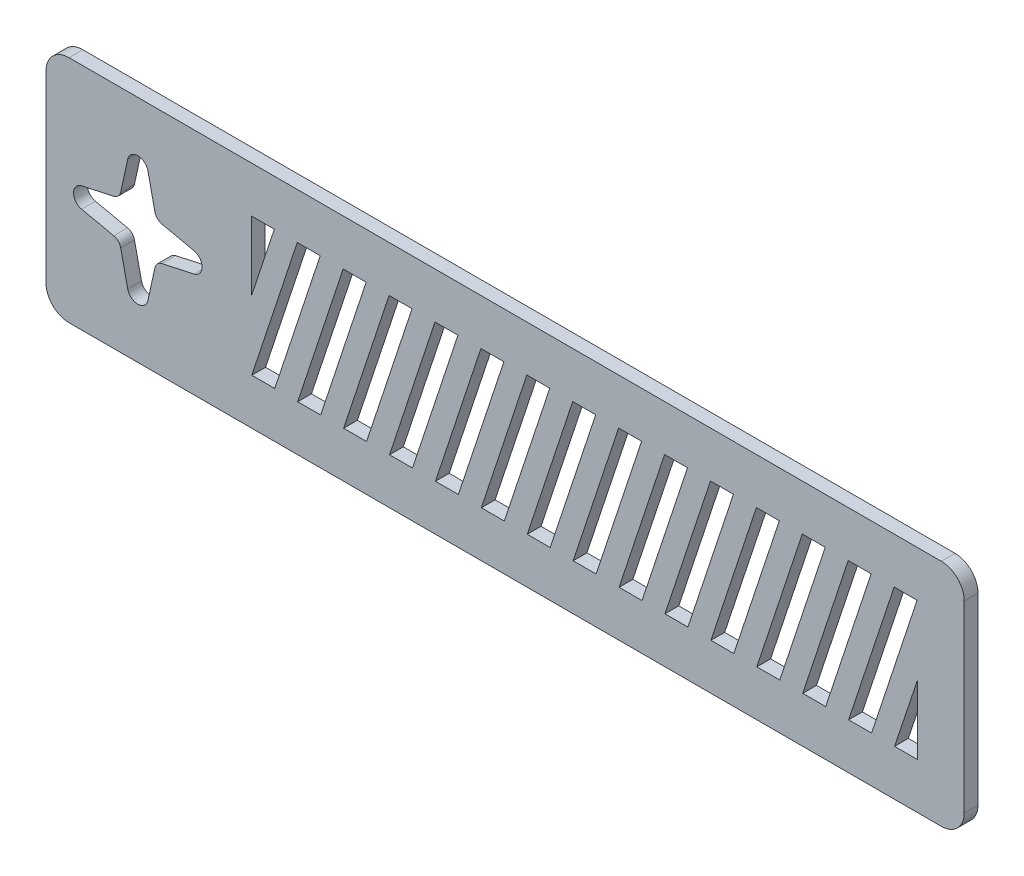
from build123d import *

# Parameters (mm, degrees)
BOSS_EXTRU_1_DEPTH = 3


with BuildPart() as part:
    # Esquisse1 → Boss.-Extru.1 (new body)
    with BuildSketch(Plane.XY):
        with BuildLine():
            Line((-29, 25), (161, 25))
            ThreePointArc((161, 25), (164.535533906, 23.535533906), (166, 20))
            Line((166, 20), (166, -20))
            ThreePointArc((166, -20), (164.535533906, -23.535533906), (161, -25))
            Line((161, -25), (-29, -25))
            ThreePointArc((-29, -25), (-32.535533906, -23.535533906), (-34, -20))
            Line((-34, -20), (-34, 20))
            ThreePointArc((-34, 20), (-32.535533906, 23.535533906), (-29, 25))
        make_face()
        with BuildLine():
            Line((-16.197942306, 12.231196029), (-17.725918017, 5.251914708))
            ThreePointArc((-17.725918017, 5.251914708), (-18.265430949, 4.265430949), (-19.251914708, 3.725918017))
            Line((-19.251914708, 3.725918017), (-26.231196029, 2.197942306))
            ThreePointArc((-26.231196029, 2.197942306), (-28, 0), (-26.231196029, -2.197942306))
            Line((-26.231196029, -2.197942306), (-19.251914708, -3.725918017))
            ThreePointArc((-19.251914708, -3.725918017), (-18.265430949, -4.265430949), (-17.725918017, -5.251914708))
            Line((-17.725918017, -5.251914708), (-16.197942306, -12.231196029))
            ThreePointArc((-16.197942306, -12.231196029), (-14, -14), (-11.802057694, -12.231196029))
            Line((-11.802057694, -12.231196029), (-10.274081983, -5.251914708))
            ThreePointArc((-10.274081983, -5.251914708), (-9.734569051, -4.265430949), (-8.748085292, -3.725918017))
            Line((-8.748085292, -3.725918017), (-1.768803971, -2.197942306))
            ThreePointArc((-1.768803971, -2.197942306), (0, 0), (-1.768803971, 2.197942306))
            Line((-1.768803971, 2.197942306), (-8.748085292, 3.725918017))
            ThreePointArc((-8.748085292, 3.725918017), (-9.734569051, 4.265430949), (-10.274081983, 5.251914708))
            Line((-10.274081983, 5.251914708), (-11.802057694, 12.231196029))
            ThreePointArc((-11.802057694, 12.231196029), (-14, 14), (-16.197942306, 12.231196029))
        make_face(mode=Mode.SUBTRACT)
        Polygon((90.823079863, -15), (95.823079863, -15), (105.728290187, 15), (100.728290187, 15), align=None, mode=Mode.SUBTRACT)
        Polygon((15.728290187, 15), (10.728290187, -0.143545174), (10.728290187, 15), align=None, mode=Mode.SUBTRACT)
        Polygon((150.823079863, -15), (155.823079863, -15), (155.823079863, 0), align=None, mode=Mode.SUBTRACT)
        Polygon((40.728290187, 15), (45.728290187, 15), (35.823079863, -15), (30.823079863, -15), align=None, mode=Mode.SUBTRACT)
        Polygon((50.728290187, 15), (55.728290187, 15), (45.823079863, -15), (40.823079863, -15), align=None, mode=Mode.SUBTRACT)
        Polygon((60.728290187, 15), (65.728290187, 15), (55.823079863, -15), (50.823079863, -15), align=None, mode=Mode.SUBTRACT)
        Polygon((70.728290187, 15), (75.728290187, 15), (65.823079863, -15), (60.823079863, -15), align=None, mode=Mode.SUBTRACT)
        Polygon((80.728290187, 15), (85.728290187, 15), (75.823079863, -15), (70.823079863, -15), align=None, mode=Mode.SUBTRACT)
        Polygon((90.728290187, 15), (95.728290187, 15), (85.823079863, -15), (80.823079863, -15), align=None, mode=Mode.SUBTRACT)
        Polygon((25.728290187, 15), (15.823079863, -15), (10.823079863, -15), (20.728290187, 15), align=None, mode=Mode.SUBTRACT)
        Polygon((100.823079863, -15), (105.823079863, -15), (115.728290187, 15), (110.728290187, 15), align=None, mode=Mode.SUBTRACT)
        Polygon((30.728290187, 15), (35.728290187, 15), (25.823079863, -15), (20.823079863, -15), align=None, mode=Mode.SUBTRACT)
        Polygon((120.728290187, 15), (125.728290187, 15), (115.823079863, -15), (110.823079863, -15), align=None, mode=Mode.SUBTRACT)
        Polygon((130.728290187, 15), (135.728290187, 15), (125.823079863, -15), (120.823079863, -15), align=None, mode=Mode.SUBTRACT)
        Polygon((140.728290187, 15), (145.728290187, 15), (135.823079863, -15), (130.823079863, -15), align=None, mode=Mode.SUBTRACT)
        Polygon((150.728290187, 15), (155.728290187, 15), (145.823079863, -15), (140.823079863, -15), align=None, mode=Mode.SUBTRACT)
    extrude(amount=BOSS_EXTRU_1_DEPTH)


solid = part.part
